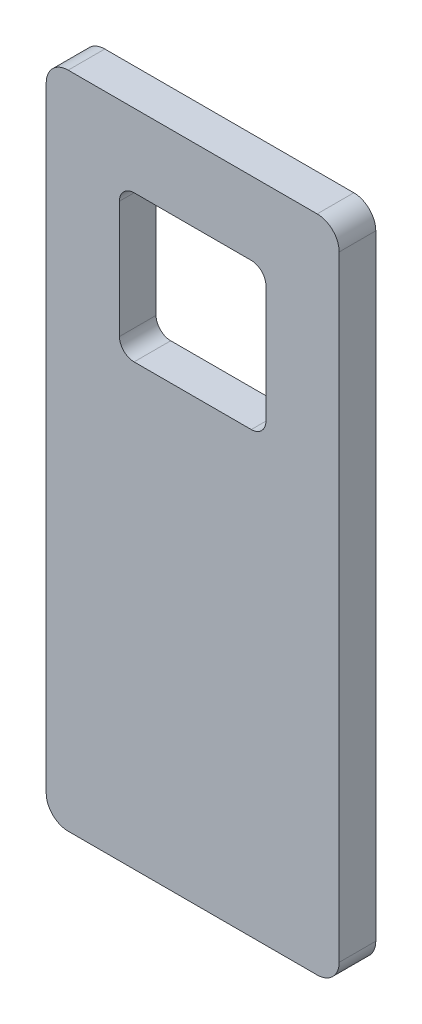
from build123d import *

# Parameters (mm, degrees)
SKETCH1_W           = 40
SKETCH1_H           = 90
BOSS_EXTRUDE1_DEPTH = 2.5
FILLET1_R           = 3
SKETCH2_W           = 20
SKETCH2_H           = 20
CUT_EXTRUDE1_DEPTH  = 50.497474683
FILLET2_R           = 2


with BuildPart() as part:
    # Sketch1 → Boss-Extrude1 (new, symmetric)
    with BuildSketch(Plane.XY):
        Rectangle(SKETCH1_W, SKETCH1_H)
    extrude(amount=BOSS_EXTRUDE1_DEPTH, both=True)

    # Fillet1
    fillet1_edges = [part.edges().sort_by_distance(p)[0] for p in [
        (-20, 45, 0),
        (20, 45, 0),
        (20, -45, 0),
        (-20, -45, 0),
    ]]
    fillet(fillet1_edges, radius=FILLET1_R)

    # Sketch2 → Cut-Extrude1 (cut, through all)
    with BuildSketch(Plane.XY.offset(2.5)):
        with Locations((0, 25)):
            Rectangle(SKETCH2_W, SKETCH2_H)
    extrude(amount=-CUT_EXTRUDE1_DEPTH, mode=Mode.SUBTRACT)

    # Fillet2
    fillet2_edges = [part.edges().sort_by_distance(p)[0] for p in [
        (-10, 15, 0),
        (-10, 35, 0),
        (10, 35, 0),
        (10, 15, 0),
    ]]
    fillet(fillet2_edges, radius=FILLET2_R)


solid = part.part
